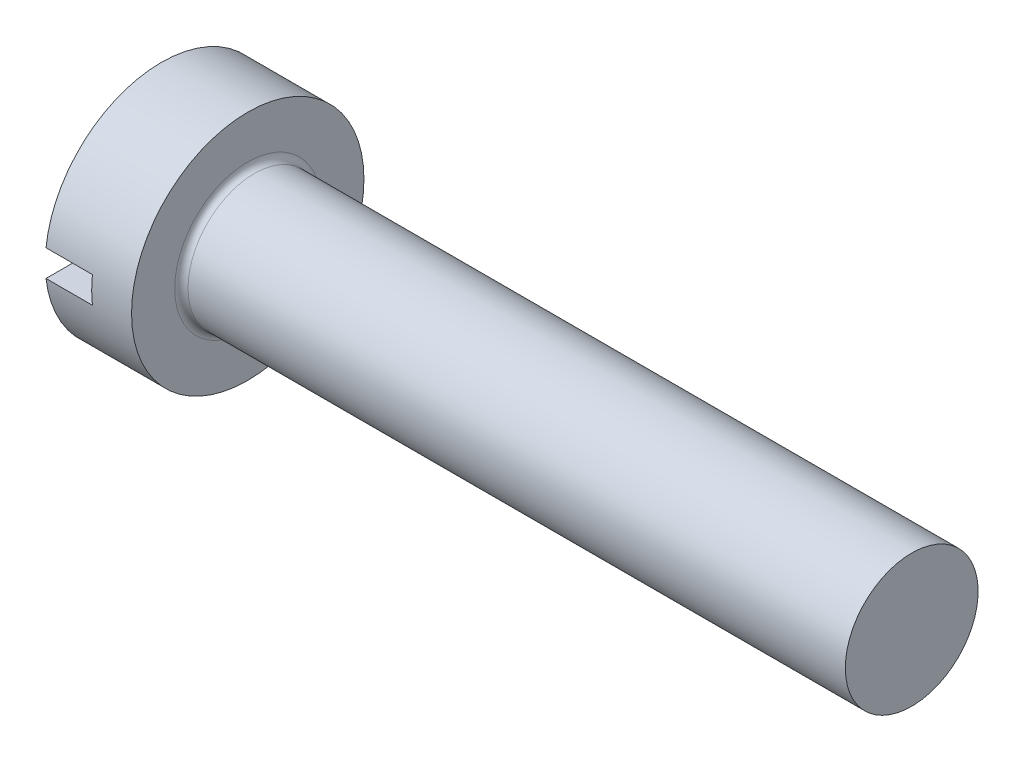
from build123d import *

# Parameters (mm, degrees)
FILLET1_R  = 0.4
SLOTSKE_W  = 14
SLOTSKE_H  = 1.6
SLOT_DEPTH = 2.8


with BuildPart() as part:
    # BodySke → BaseBody (revolve)
    with BuildSketch(Plane.XY, mode=Mode.PRIVATE) as basebody_sk:
        Polygon((5.2, 7), (5.2, 4), (45.2, 4), (45.2, 0), (0, 0), (0, 7), align=None)
    revolve(basebody_sk.sketch.rotate(Axis((0, 0, 0), (1, 0, 0)), 90), axis=Axis((0, 0, 0), (1, 0, 0)))

    # Fillet1
    fillet1_edges = [part.edges().sort_by_distance(p)[0] for p in [
        (5.2, 0, -4),
    ]]
    fillet(fillet1_edges, radius=FILLET1_R)

    # SlotSke → Slot (cut)
    with BuildSketch(Plane(origin=(0, 0, 0), x_dir=(0, 0, -1), z_dir=(1, 0, 0))):
        Rectangle(SLOTSKE_W, SLOTSKE_H)
    extrude(amount=SLOT_DEPTH, mode=Mode.SUBTRACT)


solid = part.part
